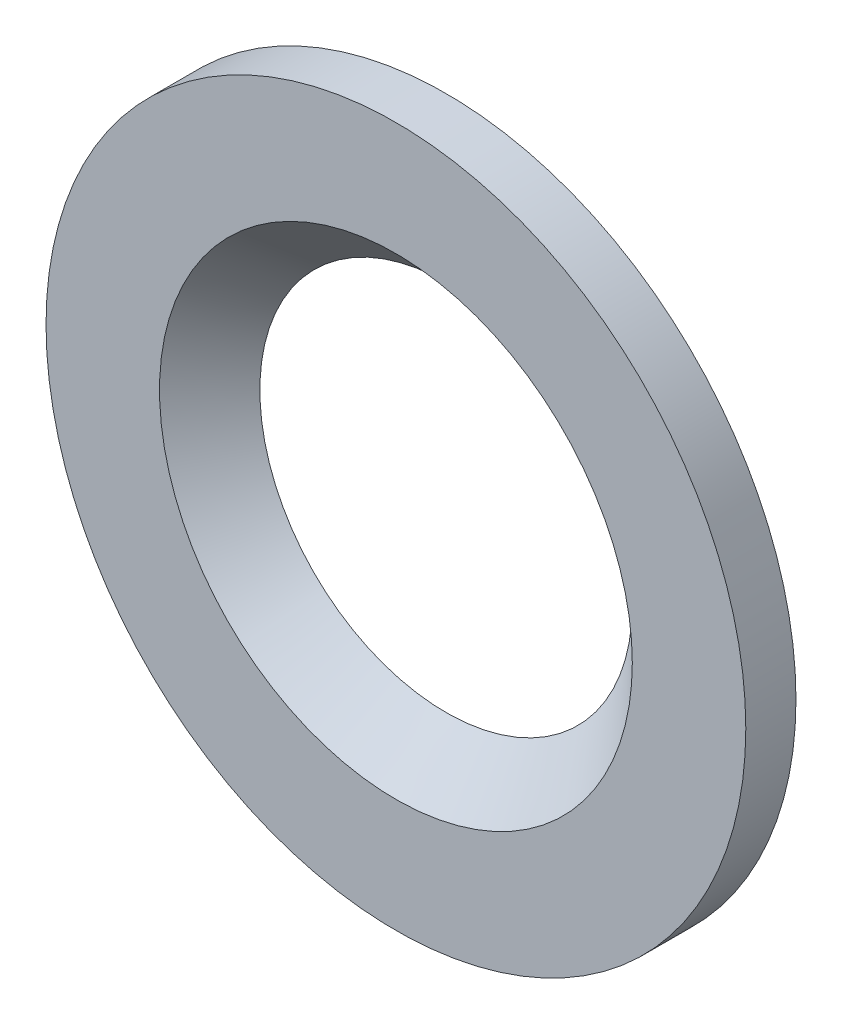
from build123d import *

# Parameters (mm, degrees)
SKETCH1_R      = 7.0866
EXTRUDE1_DEPTH = 1.016


with BuildPart() as part:
    # Sketch1 → Extrude1 (new body)
    with BuildSketch(Plane.XY):
        Circle(SKETCH1_R)
    extrude(amount=-EXTRUDE1_DEPTH)

    # Sketch2 → Cut-Revolve1 (revolve, cut)
    with BuildSketch(Plane(origin=(0, 0, 0), x_dir=(0, 0, -1), z_dir=(1, 0, 0)), mode=Mode.PRIVATE) as cut_revolve1_sk:
        Polygon((1.016, 3.7719), (1.016, 0), (0, 0), (0, 4.7879), align=None)
    revolve(cut_revolve1_sk.sketch.rotate(Axis((0, 0, 0), (0, 0, -1)), 90), axis=Axis((0, 0, 0), (0, 0, -1)), mode=Mode.SUBTRACT)


solid = part.part
